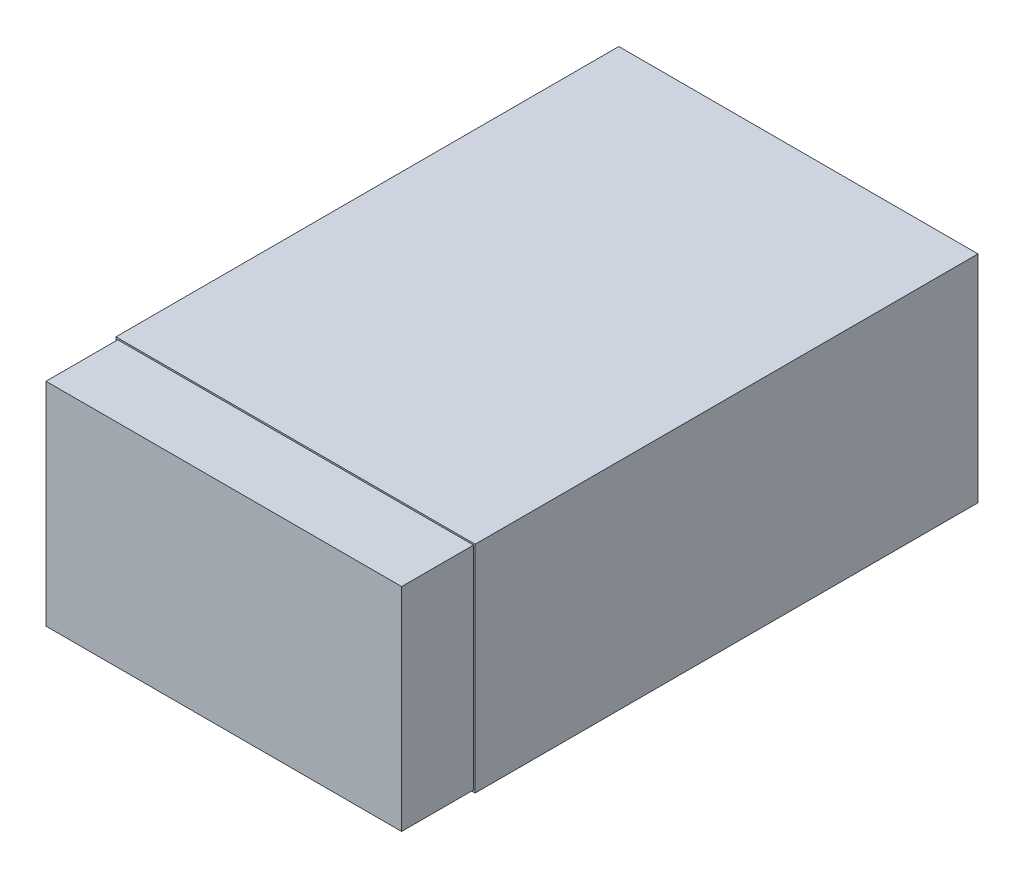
ISO-10303-21;
HEADER;
FILE_DESCRIPTION(('STEP AP214'),'2;1');
FILE_NAME('part.step','',(''),(''),'','','');
FILE_SCHEMA(('AUTOMOTIVE_DESIGN { 1 0 10303 214 1 1 1 1 }'));
ENDSEC;
DATA;
#1=APPLICATION_CONTEXT('core data for automotive mechanical design processes');
#2=APPLICATION_PROTOCOL_DEFINITION('international standard','automotive_design',2000,#1);
#3=PRODUCT_CONTEXT('',#1,'mechanical');
#4=PRODUCT('Part','Part','',(#3));
#5=PRODUCT_RELATED_PRODUCT_CATEGORY('part','',(#4));
#6=PRODUCT_DEFINITION_FORMATION('','',#4);
#7=PRODUCT_DEFINITION_CONTEXT('part definition',#1,'design');
#8=PRODUCT_DEFINITION('design','',#6,#7);
#9=PRODUCT_DEFINITION_SHAPE('','',#8);
#10=(LENGTH_UNIT() NAMED_UNIT(*) SI_UNIT(.MILLI.,.METRE.));
#11=(NAMED_UNIT(*) PLANE_ANGLE_UNIT() SI_UNIT($,.RADIAN.));
#12=(NAMED_UNIT(*) SI_UNIT($,.STERADIAN.) SOLID_ANGLE_UNIT());
#13=UNCERTAINTY_MEASURE_WITH_UNIT(LENGTH_MEASURE(1.E-05),#10,'distance_accuracy_value','');
#14=(GEOMETRIC_REPRESENTATION_CONTEXT(3) GLOBAL_UNCERTAINTY_ASSIGNED_CONTEXT((#13)) GLOBAL_UNIT_ASSIGNED_CONTEXT((#10,
#11,#12)) REPRESENTATION_CONTEXT('',''));
#15=CARTESIAN_POINT('',(0.,0.,0.));
#16=DIRECTION('',(0.,0.,1.));
#17=DIRECTION('',(1.,0.,0.));
#18=AXIS2_PLACEMENT_3D('',#15,#16,#17);
#19=CARTESIAN_POINT('',(0.,0.,35.));
#20=DIRECTION('',(0.,0.,-1.));
#21=DIRECTION('',(-1.,0.,0.));
#22=AXIS2_PLACEMENT_3D('',#19,#20,#21);
#23=PLANE('',#22);
#24=DIRECTION('',(0.,-1.,0.));
#25=VECTOR('',#24,1.);
#26=CARTESIAN_POINT('',(0.,0.,35.));
#27=LINE('',#26,#25);
#28=CARTESIAN_POINT('',(0.,15.,35.));
#29=VERTEX_POINT('',#28);
#30=CARTESIAN_POINT('',(0.,0.,35.));
#31=VERTEX_POINT('',#30);
#32=EDGE_CURVE('E143',#29,#31,#27,.T.);
#33=ORIENTED_EDGE('',*,*,#32,.T.);
#34=DIRECTION('',(1.,0.,0.));
#35=VECTOR('',#34,1.);
#36=CARTESIAN_POINT('',(0.,0.,35.));
#37=LINE('',#36,#35);
#38=CARTESIAN_POINT('',(25.,0.,35.));
#39=VERTEX_POINT('',#38);
#40=EDGE_CURVE('E147',#31,#39,#37,.T.);
#41=ORIENTED_EDGE('',*,*,#40,.T.);
#42=DIRECTION('',(0.,1.,0.));
#43=VECTOR('',#42,1.);
#44=CARTESIAN_POINT('',(25.,0.,35.));
#45=LINE('',#44,#43);
#46=CARTESIAN_POINT('',(25.,15.,35.));
#47=VERTEX_POINT('',#46);
#48=EDGE_CURVE('E151',#39,#47,#45,.T.);
#49=ORIENTED_EDGE('',*,*,#48,.T.);
#50=DIRECTION('',(-1.,0.,0.));
#51=VECTOR('',#50,1.);
#52=CARTESIAN_POINT('',(0.,15.,35.));
#53=LINE('',#52,#51);
#54=EDGE_CURVE('E154',#47,#29,#53,.T.);
#55=ORIENTED_EDGE('',*,*,#54,.T.);
#56=EDGE_LOOP('',(#33,#41,#49,#55));
#57=FACE_BOUND('',#56,.T.);
#58=DIRECTION('',(0.,-1.,0.));
#59=VECTOR('',#58,1.);
#60=CARTESIAN_POINT('',(0.134462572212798,14.8914676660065,35.));
#61=LINE('',#60,#59);
#62=CARTESIAN_POINT('',(0.134462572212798,14.8914676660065,35.));
#63=VERTEX_POINT('',#62);
#64=CARTESIAN_POINT('',(0.134462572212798,0.128428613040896,35.));
#65=VERTEX_POINT('',#64);
#66=EDGE_CURVE('E59',#63,#65,#61,.T.);
#67=ORIENTED_EDGE('',*,*,#66,.F.);
#68=DIRECTION('',(-1.,0.,0.));
#69=VECTOR('',#68,1.);
#70=CARTESIAN_POINT('',(0.134462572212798,14.8914676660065,35.));
#71=LINE('',#70,#69);
#72=CARTESIAN_POINT('',(24.8854337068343,14.8914676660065,35.));
#73=VERTEX_POINT('',#72);
#74=EDGE_CURVE('E63',#73,#63,#71,.T.);
#75=ORIENTED_EDGE('',*,*,#74,.F.);
#76=DIRECTION('',(0.,1.,0.));
#77=VECTOR('',#76,1.);
#78=CARTESIAN_POINT('',(24.8854337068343,14.8914676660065,35.));
#79=LINE('',#78,#77);
#80=CARTESIAN_POINT('',(24.8854337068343,0.128428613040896,35.));
#81=VERTEX_POINT('',#80);
#82=EDGE_CURVE('E309',#81,#73,#79,.T.);
#83=ORIENTED_EDGE('',*,*,#82,.F.);
#84=DIRECTION('',(1.,0.,0.));
#85=VECTOR('',#84,1.);
#86=CARTESIAN_POINT('',(0.134462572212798,0.128428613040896,35.));
#87=LINE('',#86,#85);
#88=EDGE_CURVE('E319',#65,#81,#87,.T.);
#89=ORIENTED_EDGE('',*,*,#88,.F.);
#90=EDGE_LOOP('',(#67,#75,#83,#89));
#91=FACE_BOUND('',#90,.T.);
#92=ADVANCED_FACE('F43',(#57,#91),#23,.F.);
#93=CARTESIAN_POINT('',(0.,0.,35.));
#94=DIRECTION('',(1.,0.,0.));
#95=DIRECTION('',(0.,0.,-1.));
#96=AXIS2_PLACEMENT_3D('',#93,#94,#95);
#97=PLANE('',#96);
#98=DIRECTION('',(0.,-1.,0.));
#99=VECTOR('',#98,1.);
#100=CARTESIAN_POINT('',(0.,0.,0.));
#101=LINE('',#100,#99);
#102=CARTESIAN_POINT('',(0.,15.,0.));
#103=VERTEX_POINT('',#102);
#104=CARTESIAN_POINT('',(0.,0.,0.));
#105=VERTEX_POINT('',#104);
#106=EDGE_CURVE('E132',#103,#105,#101,.T.);
#107=ORIENTED_EDGE('',*,*,#106,.T.);
#108=DIRECTION('',(0.,0.,-1.));
#109=VECTOR('',#108,1.);
#110=CARTESIAN_POINT('',(0.,0.,35.));
#111=LINE('',#110,#109);
#112=EDGE_CURVE('E11',#31,#105,#111,.T.);
#113=ORIENTED_EDGE('',*,*,#112,.F.);
#114=ORIENTED_EDGE('',*,*,#32,.F.);
#115=DIRECTION('',(0.,0.,-1.));
#116=VECTOR('',#115,1.);
#117=CARTESIAN_POINT('',(0.,15.,35.));
#118=LINE('',#117,#116);
#119=EDGE_CURVE('E156',#29,#103,#118,.T.);
#120=ORIENTED_EDGE('',*,*,#119,.T.);
#121=EDGE_LOOP('',(#107,#113,#114,#120));
#122=FACE_BOUND('',#121,.T.);
#123=ADVANCED_FACE('F45',(#122),#97,.F.);
#124=CARTESIAN_POINT('',(0.,0.,35.));
#125=DIRECTION('',(0.,1.,0.));
#126=DIRECTION('',(0.,0.,1.));
#127=AXIS2_PLACEMENT_3D('',#124,#125,#126);
#128=PLANE('',#127);
#129=DIRECTION('',(1.,0.,0.));
#130=VECTOR('',#129,1.);
#131=CARTESIAN_POINT('',(0.,0.,0.));
#132=LINE('',#131,#130);
#133=CARTESIAN_POINT('',(25.,0.,0.));
#134=VERTEX_POINT('',#133);
#135=EDGE_CURVE('E137',#105,#134,#132,.T.);
#136=ORIENTED_EDGE('',*,*,#135,.T.);
#137=DIRECTION('',(0.,0.,-1.));
#138=VECTOR('',#137,1.);
#139=CARTESIAN_POINT('',(25.,0.,35.));
#140=LINE('',#139,#138);
#141=EDGE_CURVE('E52',#39,#134,#140,.T.);
#142=ORIENTED_EDGE('',*,*,#141,.F.);
#143=ORIENTED_EDGE('',*,*,#40,.F.);
#144=ORIENTED_EDGE('',*,*,#112,.T.);
#145=EDGE_LOOP('',(#136,#142,#143,#144));
#146=FACE_BOUND('',#145,.T.);
#147=ADVANCED_FACE('F192',(#146),#128,.F.);
#148=CARTESIAN_POINT('',(25.,0.,35.));
#149=DIRECTION('',(-1.,0.,0.));
#150=DIRECTION('',(0.,0.,1.));
#151=AXIS2_PLACEMENT_3D('',#148,#149,#150);
#152=PLANE('',#151);
#153=DIRECTION('',(0.,1.,0.));
#154=VECTOR('',#153,1.);
#155=CARTESIAN_POINT('',(25.,0.,0.));
#156=LINE('',#155,#154);
#157=CARTESIAN_POINT('',(25.,15.,0.));
#158=VERTEX_POINT('',#157);
#159=EDGE_CURVE('E160',#134,#158,#156,.T.);
#160=ORIENTED_EDGE('',*,*,#159,.T.);
#161=DIRECTION('',(0.,0.,-1.));
#162=VECTOR('',#161,1.);
#163=CARTESIAN_POINT('',(25.,15.,35.));
#164=LINE('',#163,#162);
#165=EDGE_CURVE('E168',#47,#158,#164,.T.);
#166=ORIENTED_EDGE('',*,*,#165,.F.);
#167=ORIENTED_EDGE('',*,*,#48,.F.);
#168=ORIENTED_EDGE('',*,*,#141,.T.);
#169=EDGE_LOOP('',(#160,#166,#167,#168));
#170=FACE_BOUND('',#169,.T.);
#171=ADVANCED_FACE('F177',(#170),#152,.F.);
#172=CARTESIAN_POINT('',(0.,15.,35.));
#173=DIRECTION('',(0.,-1.,0.));
#174=DIRECTION('',(0.,0.,-1.));
#175=AXIS2_PLACEMENT_3D('',#172,#173,#174);
#176=PLANE('',#175);
#177=DIRECTION('',(-1.,0.,0.));
#178=VECTOR('',#177,1.);
#179=CARTESIAN_POINT('',(0.,15.,0.));
#180=LINE('',#179,#178);
#181=EDGE_CURVE('E148',#158,#103,#180,.T.);
#182=ORIENTED_EDGE('',*,*,#181,.T.);
#183=ORIENTED_EDGE('',*,*,#119,.F.);
#184=ORIENTED_EDGE('',*,*,#54,.F.);
#185=ORIENTED_EDGE('',*,*,#165,.T.);
#186=EDGE_LOOP('',(#182,#183,#184,#185));
#187=FACE_BOUND('',#186,.T.);
#188=ADVANCED_FACE('F186',(#187),#176,.F.);
#189=CARTESIAN_POINT('',(0.,0.,0.));
#190=DIRECTION('',(0.,0.,-1.));
#191=DIRECTION('',(-1.,0.,0.));
#192=AXIS2_PLACEMENT_3D('',#189,#190,#191);
#193=PLANE('',#192);
#194=ORIENTED_EDGE('',*,*,#106,.F.);
#195=ORIENTED_EDGE('',*,*,#181,.F.);
#196=ORIENTED_EDGE('',*,*,#159,.F.);
#197=ORIENTED_EDGE('',*,*,#135,.F.);
#198=EDGE_LOOP('',(#194,#195,#196,#197));
#199=FACE_BOUND('',#198,.T.);
#200=ADVANCED_FACE('F183',(#199),#193,.T.);
#201=CARTESIAN_POINT('',(0.134462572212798,14.8914676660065,40.));
#202=DIRECTION('',(1.,0.,0.));
#203=DIRECTION('',(0.,0.,-1.));
#204=AXIS2_PLACEMENT_3D('',#201,#202,#203);
#205=PLANE('',#204);
#206=ORIENTED_EDGE('',*,*,#66,.T.);
#207=DIRECTION('',(0.,0.,-1.));
#208=VECTOR('',#207,1.);
#209=CARTESIAN_POINT('',(0.134462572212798,0.128428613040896,40.));
#210=LINE('',#209,#208);
#211=CARTESIAN_POINT('',(0.134462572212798,0.128428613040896,40.));
#212=VERTEX_POINT('',#211);
#213=EDGE_CURVE('E112',#212,#65,#210,.T.);
#214=ORIENTED_EDGE('',*,*,#213,.F.);
#215=DIRECTION('',(0.,-1.,0.));
#216=VECTOR('',#215,1.);
#217=CARTESIAN_POINT('',(0.134462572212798,14.8914676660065,40.));
#218=LINE('',#217,#216);
#219=CARTESIAN_POINT('',(0.134462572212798,14.8914676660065,40.));
#220=VERTEX_POINT('',#219);
#221=EDGE_CURVE('E119',#220,#212,#218,.T.);
#222=ORIENTED_EDGE('',*,*,#221,.F.);
#223=DIRECTION('',(0.,0.,-1.));
#224=VECTOR('',#223,1.);
#225=CARTESIAN_POINT('',(0.134462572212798,14.8914676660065,40.));
#226=LINE('',#225,#224);
#227=EDGE_CURVE('E306',#220,#63,#226,.T.);
#228=ORIENTED_EDGE('',*,*,#227,.T.);
#229=EDGE_LOOP('',(#206,#214,#222,#228));
#230=FACE_BOUND('',#229,.T.);
#231=ADVANCED_FACE('F130',(#230),#205,.F.);
#232=CARTESIAN_POINT('',(0.134462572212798,0.128428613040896,40.));
#233=DIRECTION('',(0.,1.,0.));
#234=DIRECTION('',(0.,0.,1.));
#235=AXIS2_PLACEMENT_3D('',#232,#233,#234);
#236=PLANE('',#235);
#237=ORIENTED_EDGE('',*,*,#88,.T.);
#238=DIRECTION('',(0.,0.,-1.));
#239=VECTOR('',#238,1.);
#240=CARTESIAN_POINT('',(24.8854337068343,0.128428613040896,40.));
#241=LINE('',#240,#239);
#242=CARTESIAN_POINT('',(24.8854337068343,0.128428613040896,40.));
#243=VERTEX_POINT('',#242);
#244=EDGE_CURVE('E114',#243,#81,#241,.T.);
#245=ORIENTED_EDGE('',*,*,#244,.F.);
#246=DIRECTION('',(1.,0.,0.));
#247=VECTOR('',#246,1.);
#248=CARTESIAN_POINT('',(0.134462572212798,0.128428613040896,40.));
#249=LINE('',#248,#247);
#250=EDGE_CURVE('E107',#212,#243,#249,.T.);
#251=ORIENTED_EDGE('',*,*,#250,.F.);
#252=ORIENTED_EDGE('',*,*,#213,.T.);
#253=EDGE_LOOP('',(#237,#245,#251,#252));
#254=FACE_BOUND('',#253,.T.);
#255=ADVANCED_FACE('F110',(#254),#236,.F.);
#256=CARTESIAN_POINT('',(24.8854337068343,14.8914676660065,40.));
#257=DIRECTION('',(-1.,0.,0.));
#258=DIRECTION('',(0.,0.,1.));
#259=AXIS2_PLACEMENT_3D('',#256,#257,#258);
#260=PLANE('',#259);
#261=ORIENTED_EDGE('',*,*,#82,.T.);
#262=DIRECTION('',(0.,0.,-1.));
#263=VECTOR('',#262,1.);
#264=CARTESIAN_POINT('',(24.8854337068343,14.8914676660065,40.));
#265=LINE('',#264,#263);
#266=CARTESIAN_POINT('',(24.8854337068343,14.8914676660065,40.));
#267=VERTEX_POINT('',#266);
#268=EDGE_CURVE('E139',#267,#73,#265,.T.);
#269=ORIENTED_EDGE('',*,*,#268,.F.);
#270=DIRECTION('',(0.,1.,0.));
#271=VECTOR('',#270,1.);
#272=CARTESIAN_POINT('',(24.8854337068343,14.8914676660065,40.));
#273=LINE('',#272,#271);
#274=EDGE_CURVE('E118',#243,#267,#273,.T.);
#275=ORIENTED_EDGE('',*,*,#274,.F.);
#276=ORIENTED_EDGE('',*,*,#244,.T.);
#277=EDGE_LOOP('',(#261,#269,#275,#276));
#278=FACE_BOUND('',#277,.T.);
#279=ADVANCED_FACE('F228',(#278),#260,.F.);
#280=CARTESIAN_POINT('',(0.134462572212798,14.8914676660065,40.));
#281=DIRECTION('',(0.,-1.,0.));
#282=DIRECTION('',(0.,0.,-1.));
#283=AXIS2_PLACEMENT_3D('',#280,#281,#282);
#284=PLANE('',#283);
#285=ORIENTED_EDGE('',*,*,#74,.T.);
#286=ORIENTED_EDGE('',*,*,#227,.F.);
#287=DIRECTION('',(-1.,0.,0.));
#288=VECTOR('',#287,1.);
#289=CARTESIAN_POINT('',(0.134462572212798,14.8914676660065,40.));
#290=LINE('',#289,#288);
#291=EDGE_CURVE('E124',#267,#220,#290,.T.);
#292=ORIENTED_EDGE('',*,*,#291,.F.);
#293=ORIENTED_EDGE('',*,*,#268,.T.);
#294=EDGE_LOOP('',(#285,#286,#292,#293));
#295=FACE_BOUND('',#294,.T.);
#296=ADVANCED_FACE('F234',(#295),#284,.F.);
#297=CARTESIAN_POINT('',(0.,0.,40.));
#298=DIRECTION('',(0.,0.,1.));
#299=DIRECTION('',(1.,0.,0.));
#300=AXIS2_PLACEMENT_3D('',#297,#298,#299);
#301=PLANE('',#300);
#302=ORIENTED_EDGE('',*,*,#221,.T.);
#303=ORIENTED_EDGE('',*,*,#250,.T.);
#304=ORIENTED_EDGE('',*,*,#274,.T.);
#305=ORIENTED_EDGE('',*,*,#291,.T.);
#306=EDGE_LOOP('',(#302,#303,#304,#305));
#307=FACE_BOUND('',#306,.T.);
#308=ADVANCED_FACE('F122',(#307),#301,.T.);
#309=CLOSED_SHELL('',(#92,#123,#147,#171,#188,#200,#231,#255,#279,#296,#308));
#310=MANIFOLD_SOLID_BREP('B2',#309);
#311=ADVANCED_BREP_SHAPE_REPRESENTATION('',(#18,#310),#14);
#312=SHAPE_DEFINITION_REPRESENTATION(#9,#311);
ENDSEC;
END-ISO-10303-21;
